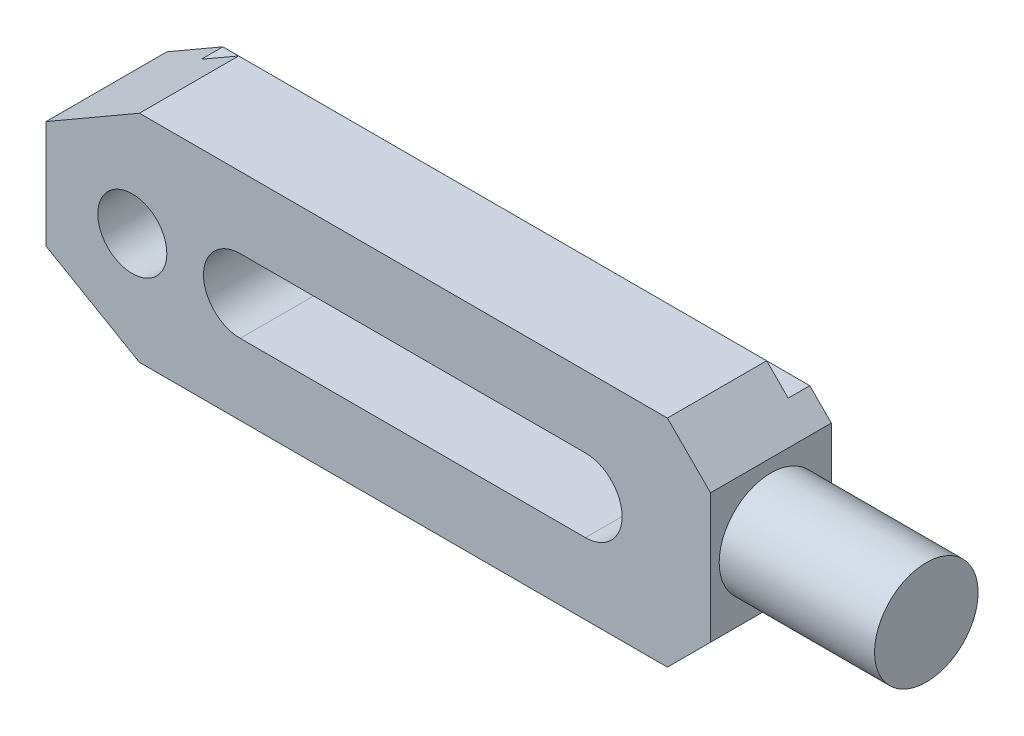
ISO-10303-21;
HEADER;
FILE_DESCRIPTION(('STEP AP214'),'2;1');
FILE_NAME('part.step','',(''),(''),'','','');
FILE_SCHEMA(('AUTOMOTIVE_DESIGN { 1 0 10303 214 1 1 1 1 }'));
ENDSEC;
DATA;
#1=APPLICATION_CONTEXT('core data for automotive mechanical design processes');
#2=APPLICATION_PROTOCOL_DEFINITION('international standard','automotive_design',2000,#1);
#3=PRODUCT_CONTEXT('',#1,'mechanical');
#4=PRODUCT('Part','Part','',(#3));
#5=PRODUCT_RELATED_PRODUCT_CATEGORY('part','',(#4));
#6=PRODUCT_DEFINITION_FORMATION('','',#4);
#7=PRODUCT_DEFINITION_CONTEXT('part definition',#1,'design');
#8=PRODUCT_DEFINITION('design','',#6,#7);
#9=PRODUCT_DEFINITION_SHAPE('','',#8);
#10=(LENGTH_UNIT() NAMED_UNIT(*) SI_UNIT(.MILLI.,.METRE.));
#11=(NAMED_UNIT(*) PLANE_ANGLE_UNIT() SI_UNIT($,.RADIAN.));
#12=(NAMED_UNIT(*) SI_UNIT($,.STERADIAN.) SOLID_ANGLE_UNIT());
#13=UNCERTAINTY_MEASURE_WITH_UNIT(LENGTH_MEASURE(1.E-05),#10,'distance_accuracy_value','');
#14=(GEOMETRIC_REPRESENTATION_CONTEXT(3) GLOBAL_UNCERTAINTY_ASSIGNED_CONTEXT((#13)) GLOBAL_UNIT_ASSIGNED_CONTEXT((#10,
#11,#12)) REPRESENTATION_CONTEXT('',''));
#15=CARTESIAN_POINT('',(0.,0.,0.));
#16=DIRECTION('',(0.,0.,1.));
#17=DIRECTION('',(1.,0.,0.));
#18=AXIS2_PLACEMENT_3D('',#15,#16,#17);
#19=CARTESIAN_POINT('',(-125.,-20.,0.));
#20=DIRECTION('',(0.,0.,-1.));
#21=DIRECTION('',(0.,-1.,0.));
#22=AXIS2_PLACEMENT_3D('',#19,#20,#21);
#23=PLANE('',#22);
#24=CARTESIAN_POINT('',(-105.,0.,0.));
#25=DIRECTION('',(0.,0.,1.));
#26=DIRECTION('',(0.,1.,0.));
#27=AXIS2_PLACEMENT_3D('',#24,#25,#26);
#28=CIRCLE('',#27,8.);
#29=CARTESIAN_POINT('',(-105.,8.,0.));
#30=VERTEX_POINT('',#29);
#31=EDGE_CURVE('E133',#30,#30,#28,.T.);
#32=ORIENTED_EDGE('',*,*,#31,.T.);
#33=EDGE_LOOP('',(#32));
#34=FACE_BOUND('',#33,.T.);
#35=DIRECTION('',(0.,1.,0.));
#36=VECTOR('',#35,1.);
#37=CARTESIAN_POINT('',(-125.,-20.,0.));
#38=LINE('',#37,#36);
#39=CARTESIAN_POINT('',(-125.,-12.5,0.));
#40=VERTEX_POINT('',#39);
#41=CARTESIAN_POINT('',(-125.,12.5,0.));
#42=VERTEX_POINT('',#41);
#43=EDGE_CURVE('E239',#40,#42,#38,.T.);
#44=ORIENTED_EDGE('',*,*,#43,.T.);
#45=DIRECTION('',(0.866025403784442,0.5,0.));
#46=VECTOR('',#45,1.);
#47=CARTESIAN_POINT('',(-125.,12.5,0.));
#48=LINE('',#47,#46);
#49=CARTESIAN_POINT('',(-112.009618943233,20.,0.));
#50=VERTEX_POINT('',#49);
#51=EDGE_CURVE('E167',#42,#50,#48,.T.);
#52=ORIENTED_EDGE('',*,*,#51,.T.);
#53=DIRECTION('',(1.,0.,0.));
#54=VECTOR('',#53,1.);
#55=CARTESIAN_POINT('',(-125.,20.,0.));
#56=LINE('',#55,#54);
#57=CARTESIAN_POINT('',(24.,20.,0.));
#58=VERTEX_POINT('',#57);
#59=EDGE_CURVE('E253',#50,#58,#56,.T.);
#60=ORIENTED_EDGE('',*,*,#59,.T.);
#61=DIRECTION('',(-0.707106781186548,0.707106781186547,0.));
#62=VECTOR('',#61,1.);
#63=CARTESIAN_POINT('',(29.,15.,0.));
#64=LINE('',#63,#62);
#65=CARTESIAN_POINT('',(29.,15.,0.));
#66=VERTEX_POINT('',#65);
#67=EDGE_CURVE('E197',#66,#58,#64,.T.);
#68=ORIENTED_EDGE('',*,*,#67,.F.);
#69=DIRECTION('',(0.,1.,0.));
#70=VECTOR('',#69,1.);
#71=CARTESIAN_POINT('',(29.,-20.,0.));
#72=LINE('',#71,#70);
#73=CARTESIAN_POINT('',(29.,-15.,0.));
#74=VERTEX_POINT('',#73);
#75=EDGE_CURVE('E235',#74,#66,#72,.T.);
#76=ORIENTED_EDGE('',*,*,#75,.F.);
#77=DIRECTION('',(-0.707106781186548,-0.707106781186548,0.));
#78=VECTOR('',#77,1.);
#79=CARTESIAN_POINT('',(29.,-15.,0.));
#80=LINE('',#79,#78);
#81=CARTESIAN_POINT('',(24.,-20.,0.));
#82=VERTEX_POINT('',#81);
#83=EDGE_CURVE('E211',#74,#82,#80,.T.);
#84=ORIENTED_EDGE('',*,*,#83,.T.);
#85=DIRECTION('',(1.,0.,0.));
#86=VECTOR('',#85,1.);
#87=CARTESIAN_POINT('',(-125.,-20.,0.));
#88=LINE('',#87,#86);
#89=CARTESIAN_POINT('',(-112.009618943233,-20.,0.));
#90=VERTEX_POINT('',#89);
#91=EDGE_CURVE('E251',#90,#82,#88,.T.);
#92=ORIENTED_EDGE('',*,*,#91,.F.);
#93=DIRECTION('',(0.866025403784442,-0.5,0.));
#94=VECTOR('',#93,1.);
#95=CARTESIAN_POINT('',(-125.,-12.5,0.));
#96=LINE('',#95,#94);
#97=EDGE_CURVE('E184',#40,#90,#96,.T.);
#98=ORIENTED_EDGE('',*,*,#97,.F.);
#99=EDGE_LOOP('',(#44,#52,#60,#68,#76,#84,#92,#98));
#100=FACE_BOUND('',#99,.T.);
#101=DIRECTION('',(-1.,0.,0.));
#102=VECTOR('',#101,1.);
#103=CARTESIAN_POINT('',(0.,-8.5,0.));
#104=LINE('',#103,#102);
#105=CARTESIAN_POINT('',(0.,-8.5,0.));
#106=VERTEX_POINT('',#105);
#107=CARTESIAN_POINT('',(-80.,-8.5,0.));
#108=VERTEX_POINT('',#107);
#109=EDGE_CURVE('E146',#106,#108,#104,.T.);
#110=ORIENTED_EDGE('',*,*,#109,.F.);
#111=CARTESIAN_POINT('',(0.,0.,0.));
#112=DIRECTION('',(0.,0.,1.));
#113=DIRECTION('',(0.,1.,0.));
#114=AXIS2_PLACEMENT_3D('',#111,#112,#113);
#115=CIRCLE('',#114,8.5);
#116=CARTESIAN_POINT('',(0.,8.5,0.));
#117=VERTEX_POINT('',#116);
#118=EDGE_CURVE('E29',#106,#117,#115,.T.);
#119=ORIENTED_EDGE('',*,*,#118,.T.);
#120=DIRECTION('',(1.,0.,0.));
#121=VECTOR('',#120,1.);
#122=CARTESIAN_POINT('',(-80.,8.5,0.));
#123=LINE('',#122,#121);
#124=CARTESIAN_POINT('',(-80.,8.5,0.));
#125=VERTEX_POINT('',#124);
#126=EDGE_CURVE('E137',#125,#117,#123,.T.);
#127=ORIENTED_EDGE('',*,*,#126,.F.);
#128=CARTESIAN_POINT('',(-80.,0.,0.));
#129=DIRECTION('',(0.,0.,1.));
#130=DIRECTION('',(0.,1.,0.));
#131=AXIS2_PLACEMENT_3D('',#128,#129,#130);
#132=CIRCLE('',#131,8.5);
#133=EDGE_CURVE('E142',#125,#108,#132,.T.);
#134=ORIENTED_EDGE('',*,*,#133,.T.);
#135=EDGE_LOOP('',(#110,#119,#127,#134));
#136=FACE_BOUND('',#135,.T.);
#137=ADVANCED_FACE('F14',(#34,#100,#136),#23,.T.);
#138=CARTESIAN_POINT('',(-125.,25.,28.));
#139=DIRECTION('',(0.,0.,1.));
#140=DIRECTION('',(0.,1.,0.));
#141=AXIS2_PLACEMENT_3D('',#138,#139,#140);
#142=PLANE('',#141);
#143=CARTESIAN_POINT('',(-105.,0.,28.));
#144=DIRECTION('',(0.,0.,1.));
#145=DIRECTION('',(0.,1.,0.));
#146=AXIS2_PLACEMENT_3D('',#143,#144,#145);
#147=CIRCLE('',#146,8.);
#148=CARTESIAN_POINT('',(-105.,8.,28.));
#149=VERTEX_POINT('',#148);
#150=EDGE_CURVE('E164',#149,#149,#147,.T.);
#151=ORIENTED_EDGE('',*,*,#150,.F.);
#152=EDGE_LOOP('',(#151));
#153=FACE_BOUND('',#152,.T.);
#154=DIRECTION('',(1.,0.,0.));
#155=VECTOR('',#154,1.);
#156=CARTESIAN_POINT('',(-125.,25.,28.));
#157=LINE('',#156,#155);
#158=CARTESIAN_POINT('',(-103.349364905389,25.,28.));
#159=VERTEX_POINT('',#158);
#160=CARTESIAN_POINT('',(19.,25.,28.));
#161=VERTEX_POINT('',#160);
#162=EDGE_CURVE('E242',#159,#161,#157,.T.);
#163=ORIENTED_EDGE('',*,*,#162,.F.);
#164=DIRECTION('',(0.866025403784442,0.5,0.));
#165=VECTOR('',#164,1.);
#166=CARTESIAN_POINT('',(-125.,12.5,28.));
#167=LINE('',#166,#165);
#168=CARTESIAN_POINT('',(-125.,12.5,28.));
#169=VERTEX_POINT('',#168);
#170=EDGE_CURVE('E170',#169,#159,#167,.T.);
#171=ORIENTED_EDGE('',*,*,#170,.F.);
#172=DIRECTION('',(0.,-1.,0.));
#173=VECTOR('',#172,1.);
#174=CARTESIAN_POINT('',(-125.,25.,28.));
#175=LINE('',#174,#173);
#176=CARTESIAN_POINT('',(-125.,-12.5,28.));
#177=VERTEX_POINT('',#176);
#178=EDGE_CURVE('E238',#169,#177,#175,.T.);
#179=ORIENTED_EDGE('',*,*,#178,.T.);
#180=DIRECTION('',(0.866025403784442,-0.5,0.));
#181=VECTOR('',#180,1.);
#182=CARTESIAN_POINT('',(-125.,-12.5,28.));
#183=LINE('',#182,#181);
#184=CARTESIAN_POINT('',(-103.349364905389,-25.,28.));
#185=VERTEX_POINT('',#184);
#186=EDGE_CURVE('E186',#177,#185,#183,.T.);
#187=ORIENTED_EDGE('',*,*,#186,.T.);
#188=DIRECTION('',(1.,0.,0.));
#189=VECTOR('',#188,1.);
#190=CARTESIAN_POINT('',(-125.,-25.,28.));
#191=LINE('',#190,#189);
#192=CARTESIAN_POINT('',(19.,-25.,28.));
#193=VERTEX_POINT('',#192);
#194=EDGE_CURVE('E245',#185,#193,#191,.T.);
#195=ORIENTED_EDGE('',*,*,#194,.T.);
#196=DIRECTION('',(-0.707106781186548,-0.707106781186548,0.));
#197=VECTOR('',#196,1.);
#198=CARTESIAN_POINT('',(29.,-15.,28.));
#199=LINE('',#198,#197);
#200=CARTESIAN_POINT('',(29.,-15.,28.));
#201=VERTEX_POINT('',#200);
#202=EDGE_CURVE('E214',#201,#193,#199,.T.);
#203=ORIENTED_EDGE('',*,*,#202,.F.);
#204=DIRECTION('',(0.,-1.,0.));
#205=VECTOR('',#204,1.);
#206=CARTESIAN_POINT('',(29.,25.,28.));
#207=LINE('',#206,#205);
#208=CARTESIAN_POINT('',(29.,15.,28.));
#209=VERTEX_POINT('',#208);
#210=EDGE_CURVE('E22',#209,#201,#207,.T.);
#211=ORIENTED_EDGE('',*,*,#210,.F.);
#212=DIRECTION('',(-0.707106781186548,0.707106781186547,0.));
#213=VECTOR('',#212,1.);
#214=CARTESIAN_POINT('',(29.,15.,28.));
#215=LINE('',#214,#213);
#216=EDGE_CURVE('E200',#209,#161,#215,.T.);
#217=ORIENTED_EDGE('',*,*,#216,.T.);
#218=EDGE_LOOP('',(#163,#171,#179,#187,#195,#203,#211,#217));
#219=FACE_BOUND('',#218,.T.);
#220=DIRECTION('',(1.,0.,0.));
#221=VECTOR('',#220,1.);
#222=CARTESIAN_POINT('',(-80.,8.5,28.));
#223=LINE('',#222,#221);
#224=CARTESIAN_POINT('',(-80.,8.5,28.));
#225=VERTEX_POINT('',#224);
#226=CARTESIAN_POINT('',(0.,8.5,28.));
#227=VERTEX_POINT('',#226);
#228=EDGE_CURVE('E155',#225,#227,#223,.T.);
#229=ORIENTED_EDGE('',*,*,#228,.T.);
#230=CARTESIAN_POINT('',(0.,0.,28.));
#231=DIRECTION('',(0.,0.,1.));
#232=DIRECTION('',(0.,1.,0.));
#233=AXIS2_PLACEMENT_3D('',#230,#231,#232);
#234=CIRCLE('',#233,8.5);
#235=CARTESIAN_POINT('',(0.,-8.5,28.));
#236=VERTEX_POINT('',#235);
#237=EDGE_CURVE('E129',#236,#227,#234,.T.);
#238=ORIENTED_EDGE('',*,*,#237,.F.);
#239=DIRECTION('',(-1.,0.,0.));
#240=VECTOR('',#239,1.);
#241=CARTESIAN_POINT('',(0.,-8.5,28.));
#242=LINE('',#241,#240);
#243=CARTESIAN_POINT('',(-80.,-8.5,28.));
#244=VERTEX_POINT('',#243);
#245=EDGE_CURVE('E150',#236,#244,#242,.T.);
#246=ORIENTED_EDGE('',*,*,#245,.T.);
#247=CARTESIAN_POINT('',(-80.,0.,28.));
#248=DIRECTION('',(0.,0.,1.));
#249=DIRECTION('',(0.,1.,0.));
#250=AXIS2_PLACEMENT_3D('',#247,#248,#249);
#251=CIRCLE('',#250,8.5);
#252=EDGE_CURVE('E37',#225,#244,#251,.T.);
#253=ORIENTED_EDGE('',*,*,#252,.F.);
#254=EDGE_LOOP('',(#229,#238,#246,#253));
#255=FACE_BOUND('',#254,.T.);
#256=ADVANCED_FACE('F271',(#153,#219,#255),#142,.T.);
#257=CARTESIAN_POINT('',(-125.,25.,5.));
#258=DIRECTION('',(0.,1.,0.));
#259=DIRECTION('',(0.,0.,-1.));
#260=AXIS2_PLACEMENT_3D('',#257,#258,#259);
#261=PLANE('',#260);
#262=DIRECTION('',(1.,0.,0.));
#263=VECTOR('',#262,1.);
#264=CARTESIAN_POINT('',(-125.,25.,5.));
#265=LINE('',#264,#263);
#266=CARTESIAN_POINT('',(-103.349364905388,25.,5.));
#267=VERTEX_POINT('',#266);
#268=CARTESIAN_POINT('',(19.,25.,5.));
#269=VERTEX_POINT('',#268);
#270=EDGE_CURVE('E257',#267,#269,#265,.T.);
#271=ORIENTED_EDGE('',*,*,#270,.F.);
#272=DIRECTION('',(0.,0.,1.));
#273=VECTOR('',#272,1.);
#274=CARTESIAN_POINT('',(-103.349364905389,25.,5.));
#275=LINE('',#274,#273);
#276=EDGE_CURVE('E181',#267,#159,#275,.T.);
#277=ORIENTED_EDGE('',*,*,#276,.T.);
#278=ORIENTED_EDGE('',*,*,#162,.T.);
#279=DIRECTION('',(0.,0.,-1.));
#280=VECTOR('',#279,1.);
#281=CARTESIAN_POINT('',(19.,25.,28.));
#282=LINE('',#281,#280);
#283=EDGE_CURVE('E205',#161,#269,#282,.T.);
#284=ORIENTED_EDGE('',*,*,#283,.T.);
#285=EDGE_LOOP('',(#271,#277,#278,#284));
#286=FACE_BOUND('',#285,.T.);
#287=ADVANCED_FACE('F303',(#286),#261,.T.);
#288=CARTESIAN_POINT('',(-125.,20.,5.));
#289=DIRECTION('',(0.,0.,-1.));
#290=DIRECTION('',(0.,-1.,0.));
#291=AXIS2_PLACEMENT_3D('',#288,#289,#290);
#292=PLANE('',#291);
#293=DIRECTION('',(1.,0.,0.));
#294=VECTOR('',#293,1.);
#295=CARTESIAN_POINT('',(-125.,20.,5.));
#296=LINE('',#295,#294);
#297=CARTESIAN_POINT('',(-112.009618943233,20.,5.));
#298=VERTEX_POINT('',#297);
#299=CARTESIAN_POINT('',(24.,20.,5.));
#300=VERTEX_POINT('',#299);
#301=EDGE_CURVE('E255',#298,#300,#296,.T.);
#302=ORIENTED_EDGE('',*,*,#301,.F.);
#303=DIRECTION('',(0.866025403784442,0.5,0.));
#304=VECTOR('',#303,1.);
#305=CARTESIAN_POINT('',(-121.752404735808,14.375,5.));
#306=LINE('',#305,#304);
#307=EDGE_CURVE('E178',#298,#267,#306,.T.);
#308=ORIENTED_EDGE('',*,*,#307,.T.);
#309=ORIENTED_EDGE('',*,*,#270,.T.);
#310=DIRECTION('',(-0.707106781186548,0.707106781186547,0.));
#311=VECTOR('',#310,1.);
#312=CARTESIAN_POINT('',(-50.5,94.5,5.));
#313=LINE('',#312,#311);
#314=EDGE_CURVE('E208',#300,#269,#313,.T.);
#315=ORIENTED_EDGE('',*,*,#314,.F.);
#316=EDGE_LOOP('',(#302,#308,#309,#315));
#317=FACE_BOUND('',#316,.T.);
#318=ADVANCED_FACE('F16',(#317),#292,.T.);
#319=CARTESIAN_POINT('',(-125.,20.,0.));
#320=DIRECTION('',(0.,1.,0.));
#321=DIRECTION('',(0.,0.,-1.));
#322=AXIS2_PLACEMENT_3D('',#319,#320,#321);
#323=PLANE('',#322);
#324=ORIENTED_EDGE('',*,*,#59,.F.);
#325=DIRECTION('',(0.,0.,1.));
#326=VECTOR('',#325,1.);
#327=CARTESIAN_POINT('',(-112.009618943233,20.,0.));
#328=LINE('',#327,#326);
#329=EDGE_CURVE('E175',#50,#298,#328,.T.);
#330=ORIENTED_EDGE('',*,*,#329,.T.);
#331=ORIENTED_EDGE('',*,*,#301,.T.);
#332=DIRECTION('',(0.,0.,1.));
#333=VECTOR('',#332,1.);
#334=CARTESIAN_POINT('',(24.,20.,-1.05838731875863E-13));
#335=LINE('',#334,#333);
#336=EDGE_CURVE('E9',#58,#300,#335,.T.);
#337=ORIENTED_EDGE('',*,*,#336,.F.);
#338=EDGE_LOOP('',(#324,#330,#331,#337));
#339=FACE_BOUND('',#338,.T.);
#340=ADVANCED_FACE('F297',(#339),#323,.T.);
#341=CARTESIAN_POINT('',(-125.,25.,28.));
#342=DIRECTION('',(1.,0.,0.));
#343=DIRECTION('',(0.,0.,-1.));
#344=AXIS2_PLACEMENT_3D('',#341,#342,#343);
#345=PLANE('',#344);
#346=DIRECTION('',(0.,0.,-1.));
#347=VECTOR('',#346,1.);
#348=CARTESIAN_POINT('',(-125.,12.5,28.));
#349=LINE('',#348,#347);
#350=EDGE_CURVE('E172',#169,#42,#349,.T.);
#351=ORIENTED_EDGE('',*,*,#350,.T.);
#352=ORIENTED_EDGE('',*,*,#43,.F.);
#353=DIRECTION('',(0.,0.,-1.));
#354=VECTOR('',#353,1.);
#355=CARTESIAN_POINT('',(-125.,-12.5,28.));
#356=LINE('',#355,#354);
#357=EDGE_CURVE('E189',#177,#40,#356,.T.);
#358=ORIENTED_EDGE('',*,*,#357,.F.);
#359=ORIENTED_EDGE('',*,*,#178,.F.);
#360=EDGE_LOOP('',(#351,#352,#358,#359));
#361=FACE_BOUND('',#360,.T.);
#362=ADVANCED_FACE('F309',(#361),#345,.F.);
#363=CARTESIAN_POINT('',(-125.,-20.,5.));
#364=DIRECTION('',(0.,-1.,0.));
#365=DIRECTION('',(0.,0.,1.));
#366=AXIS2_PLACEMENT_3D('',#363,#364,#365);
#367=PLANE('',#366);
#368=DIRECTION('',(0.,0.,1.));
#369=VECTOR('',#368,1.);
#370=CARTESIAN_POINT('',(-112.009618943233,-20.,5.));
#371=LINE('',#370,#369);
#372=CARTESIAN_POINT('',(-112.009618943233,-20.,5.));
#373=VERTEX_POINT('',#372);
#374=EDGE_CURVE('E195',#90,#373,#371,.T.);
#375=ORIENTED_EDGE('',*,*,#374,.F.);
#376=ORIENTED_EDGE('',*,*,#91,.T.);
#377=DIRECTION('',(0.,0.,1.));
#378=VECTOR('',#377,1.);
#379=CARTESIAN_POINT('',(24.,-20.,5.0000000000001));
#380=LINE('',#379,#378);
#381=CARTESIAN_POINT('',(24.,-20.,5.));
#382=VERTEX_POINT('',#381);
#383=EDGE_CURVE('E226',#82,#382,#380,.T.);
#384=ORIENTED_EDGE('',*,*,#383,.T.);
#385=DIRECTION('',(1.,0.,0.));
#386=VECTOR('',#385,1.);
#387=CARTESIAN_POINT('',(-125.,-20.,5.));
#388=LINE('',#387,#386);
#389=EDGE_CURVE('E249',#373,#382,#388,.T.);
#390=ORIENTED_EDGE('',*,*,#389,.F.);
#391=EDGE_LOOP('',(#375,#376,#384,#390));
#392=FACE_BOUND('',#391,.T.);
#393=ADVANCED_FACE('F286',(#392),#367,.T.);
#394=CARTESIAN_POINT('',(-125.,-25.,5.));
#395=DIRECTION('',(0.,0.,-1.));
#396=DIRECTION('',(0.,-1.,0.));
#397=AXIS2_PLACEMENT_3D('',#394,#395,#396);
#398=PLANE('',#397);
#399=DIRECTION('',(0.866025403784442,-0.5,0.));
#400=VECTOR('',#399,1.);
#401=CARTESIAN_POINT('',(-119.587341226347,-15.625,5.));
#402=LINE('',#401,#400);
#403=CARTESIAN_POINT('',(-103.349364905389,-25.,5.));
#404=VERTEX_POINT('',#403);
#405=EDGE_CURVE('E193',#373,#404,#402,.T.);
#406=ORIENTED_EDGE('',*,*,#405,.F.);
#407=ORIENTED_EDGE('',*,*,#389,.T.);
#408=DIRECTION('',(-0.707106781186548,-0.707106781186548,0.));
#409=VECTOR('',#408,1.);
#410=CARTESIAN_POINT('',(-53.,-97.,5.));
#411=LINE('',#410,#409);
#412=CARTESIAN_POINT('',(19.,-25.,5.));
#413=VERTEX_POINT('',#412);
#414=EDGE_CURVE('E223',#382,#413,#411,.T.);
#415=ORIENTED_EDGE('',*,*,#414,.T.);
#416=DIRECTION('',(1.,0.,0.));
#417=VECTOR('',#416,1.);
#418=CARTESIAN_POINT('',(-125.,-25.,5.));
#419=LINE('',#418,#417);
#420=EDGE_CURVE('E247',#404,#413,#419,.T.);
#421=ORIENTED_EDGE('',*,*,#420,.F.);
#422=EDGE_LOOP('',(#406,#407,#415,#421));
#423=FACE_BOUND('',#422,.T.);
#424=ADVANCED_FACE('F282',(#423),#398,.T.);
#425=CARTESIAN_POINT('',(-125.,-25.,28.));
#426=DIRECTION('',(0.,-1.,0.));
#427=DIRECTION('',(0.,0.,1.));
#428=AXIS2_PLACEMENT_3D('',#425,#426,#427);
#429=PLANE('',#428);
#430=DIRECTION('',(0.,0.,1.));
#431=VECTOR('',#430,1.);
#432=CARTESIAN_POINT('',(-103.349364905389,-25.,28.));
#433=LINE('',#432,#431);
#434=EDGE_CURVE('E191',#404,#185,#433,.T.);
#435=ORIENTED_EDGE('',*,*,#434,.F.);
#436=ORIENTED_EDGE('',*,*,#420,.T.);
#437=DIRECTION('',(0.,0.,-1.));
#438=VECTOR('',#437,1.);
#439=CARTESIAN_POINT('',(19.,-25.,28.));
#440=LINE('',#439,#438);
#441=EDGE_CURVE('E217',#193,#413,#440,.T.);
#442=ORIENTED_EDGE('',*,*,#441,.F.);
#443=ORIENTED_EDGE('',*,*,#194,.F.);
#444=EDGE_LOOP('',(#435,#436,#442,#443));
#445=FACE_BOUND('',#444,.T.);
#446=ADVANCED_FACE('F277',(#445),#429,.T.);
#447=CARTESIAN_POINT('',(29.,-30.,30.));
#448=DIRECTION('',(-1.,0.,0.));
#449=DIRECTION('',(0.,0.,1.));
#450=AXIS2_PLACEMENT_3D('',#447,#448,#449);
#451=PLANE('',#450);
#452=CARTESIAN_POINT('',(29.,0.,14.));
#453=DIRECTION('',(-1.,0.,0.));
#454=DIRECTION('',(0.,0.,1.));
#455=AXIS2_PLACEMENT_3D('',#452,#453,#454);
#456=CIRCLE('',#455,12.);
#457=CARTESIAN_POINT('',(29.,0.,26.));
#458=VERTEX_POINT('',#457);
#459=EDGE_CURVE('E232',#458,#458,#456,.T.);
#460=ORIENTED_EDGE('',*,*,#459,.T.);
#461=EDGE_LOOP('',(#460));
#462=FACE_BOUND('',#461,.T.);
#463=ORIENTED_EDGE('',*,*,#75,.T.);
#464=DIRECTION('',(0.,0.,-1.));
#465=VECTOR('',#464,1.);
#466=CARTESIAN_POINT('',(29.,15.,28.));
#467=LINE('',#466,#465);
#468=EDGE_CURVE('E203',#209,#66,#467,.T.);
#469=ORIENTED_EDGE('',*,*,#468,.F.);
#470=ORIENTED_EDGE('',*,*,#210,.T.);
#471=DIRECTION('',(0.,0.,-1.));
#472=VECTOR('',#471,1.);
#473=CARTESIAN_POINT('',(29.,-15.,28.));
#474=LINE('',#473,#472);
#475=EDGE_CURVE('E220',#201,#74,#474,.T.);
#476=ORIENTED_EDGE('',*,*,#475,.T.);
#477=EDGE_LOOP('',(#463,#469,#470,#476));
#478=FACE_BOUND('',#477,.T.);
#479=ADVANCED_FACE('F262',(#462,#478),#451,.F.);
#480=CARTESIAN_POINT('',(29.,0.,14.));
#481=DIRECTION('',(1.,0.,0.));
#482=DIRECTION('',(0.,0.,-1.));
#483=AXIS2_PLACEMENT_3D('',#480,#481,#482);
#484=CYLINDRICAL_SURFACE('',#483,12.);
#485=ORIENTED_EDGE('',*,*,#459,.F.);
#486=EDGE_LOOP('',(#485));
#487=FACE_BOUND('',#486,.T.);
#488=CARTESIAN_POINT('',(65.,0.,14.));
#489=DIRECTION('',(-1.,0.,0.));
#490=DIRECTION('',(0.,0.,1.));
#491=AXIS2_PLACEMENT_3D('',#488,#489,#490);
#492=CIRCLE('',#491,12.);
#493=CARTESIAN_POINT('',(65.,0.,26.));
#494=VERTEX_POINT('',#493);
#495=EDGE_CURVE('E229',#494,#494,#492,.T.);
#496=ORIENTED_EDGE('',*,*,#495,.T.);
#497=EDGE_LOOP('',(#496));
#498=FACE_BOUND('',#497,.T.);
#499=ADVANCED_FACE('F465',(#487,#498),#484,.T.);
#500=CARTESIAN_POINT('',(65.,25.,28.));
#501=DIRECTION('',(1.,0.,0.));
#502=DIRECTION('',(0.,0.,-1.));
#503=AXIS2_PLACEMENT_3D('',#500,#501,#502);
#504=PLANE('',#503);
#505=ORIENTED_EDGE('',*,*,#495,.F.);
#506=EDGE_LOOP('',(#505));
#507=FACE_BOUND('',#506,.T.);
#508=ADVANCED_FACE('F457',(#507),#504,.T.);
#509=CARTESIAN_POINT('',(29.,-15.,28.));
#510=DIRECTION('',(0.707106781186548,-0.707106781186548,0.));
#511=DIRECTION('',(0.707106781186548,0.707106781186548,0.));
#512=AXIS2_PLACEMENT_3D('',#509,#510,#511);
#513=PLANE('',#512);
#514=ORIENTED_EDGE('',*,*,#83,.F.);
#515=ORIENTED_EDGE('',*,*,#475,.F.);
#516=ORIENTED_EDGE('',*,*,#202,.T.);
#517=ORIENTED_EDGE('',*,*,#441,.T.);
#518=ORIENTED_EDGE('',*,*,#414,.F.);
#519=ORIENTED_EDGE('',*,*,#383,.F.);
#520=EDGE_LOOP('',(#514,#515,#516,#517,#518,#519));
#521=FACE_BOUND('',#520,.T.);
#522=ADVANCED_FACE('F267',(#521),#513,.T.);
#523=CARTESIAN_POINT('',(29.,15.,28.));
#524=DIRECTION('',(-0.707106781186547,-0.707106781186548,0.));
#525=DIRECTION('',(0.707106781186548,-0.707106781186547,0.));
#526=AXIS2_PLACEMENT_3D('',#523,#524,#525);
#527=PLANE('',#526);
#528=ORIENTED_EDGE('',*,*,#314,.T.);
#529=ORIENTED_EDGE('',*,*,#283,.F.);
#530=ORIENTED_EDGE('',*,*,#216,.F.);
#531=ORIENTED_EDGE('',*,*,#468,.T.);
#532=ORIENTED_EDGE('',*,*,#67,.T.);
#533=ORIENTED_EDGE('',*,*,#336,.T.);
#534=EDGE_LOOP('',(#528,#529,#530,#531,#532,#533));
#535=FACE_BOUND('',#534,.T.);
#536=ADVANCED_FACE('F294',(#535),#527,.F.);
#537=CARTESIAN_POINT('',(-125.,-12.5,28.));
#538=DIRECTION('',(0.5,0.866025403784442,0.));
#539=DIRECTION('',(-0.866025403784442,0.5,0.));
#540=AXIS2_PLACEMENT_3D('',#537,#538,#539);
#541=PLANE('',#540);
#542=ORIENTED_EDGE('',*,*,#374,.T.);
#543=ORIENTED_EDGE('',*,*,#405,.T.);
#544=ORIENTED_EDGE('',*,*,#434,.T.);
#545=ORIENTED_EDGE('',*,*,#186,.F.);
#546=ORIENTED_EDGE('',*,*,#357,.T.);
#547=ORIENTED_EDGE('',*,*,#97,.T.);
#548=EDGE_LOOP('',(#542,#543,#544,#545,#546,#547));
#549=FACE_BOUND('',#548,.T.);
#550=ADVANCED_FACE('F312',(#549),#541,.F.);
#551=CARTESIAN_POINT('',(-125.,12.5,28.));
#552=DIRECTION('',(-0.5,0.866025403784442,0.));
#553=DIRECTION('',(-0.866025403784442,-0.5,0.));
#554=AXIS2_PLACEMENT_3D('',#551,#552,#553);
#555=PLANE('',#554);
#556=ORIENTED_EDGE('',*,*,#307,.F.);
#557=ORIENTED_EDGE('',*,*,#329,.F.);
#558=ORIENTED_EDGE('',*,*,#51,.F.);
#559=ORIENTED_EDGE('',*,*,#350,.F.);
#560=ORIENTED_EDGE('',*,*,#170,.T.);
#561=ORIENTED_EDGE('',*,*,#276,.F.);
#562=EDGE_LOOP('',(#556,#557,#558,#559,#560,#561));
#563=FACE_BOUND('',#562,.T.);
#564=ADVANCED_FACE('F313',(#563),#555,.T.);
#565=CARTESIAN_POINT('',(-105.,0.,28.));
#566=DIRECTION('',(0.,0.,-1.));
#567=DIRECTION('',(0.,-1.,0.));
#568=AXIS2_PLACEMENT_3D('',#565,#566,#567);
#569=CYLINDRICAL_SURFACE('',#568,8.);
#570=ORIENTED_EDGE('',*,*,#150,.T.);
#571=EDGE_LOOP('',(#570));
#572=FACE_BOUND('',#571,.T.);
#573=ORIENTED_EDGE('',*,*,#31,.F.);
#574=EDGE_LOOP('',(#573));
#575=FACE_BOUND('',#574,.T.);
#576=ADVANCED_FACE('F315',(#572,#575),#569,.F.);
#577=CARTESIAN_POINT('',(0.,0.,28.));
#578=DIRECTION('',(0.,0.,-1.));
#579=DIRECTION('',(0.,-1.,0.));
#580=AXIS2_PLACEMENT_3D('',#577,#578,#579);
#581=CYLINDRICAL_SURFACE('',#580,8.5);
#582=DIRECTION('',(0.,0.,-1.));
#583=VECTOR('',#582,1.);
#584=CARTESIAN_POINT('',(0.,8.5,28.));
#585=LINE('',#584,#583);
#586=EDGE_CURVE('E125',#227,#117,#585,.T.);
#587=ORIENTED_EDGE('',*,*,#586,.T.);
#588=ORIENTED_EDGE('',*,*,#118,.F.);
#589=DIRECTION('',(0.,0.,-1.));
#590=VECTOR('',#589,1.);
#591=CARTESIAN_POINT('',(0.,-8.5,28.));
#592=LINE('',#591,#590);
#593=EDGE_CURVE('E153',#236,#106,#592,.T.);
#594=ORIENTED_EDGE('',*,*,#593,.F.);
#595=ORIENTED_EDGE('',*,*,#237,.T.);
#596=EDGE_LOOP('',(#587,#588,#594,#595));
#597=FACE_BOUND('',#596,.T.);
#598=ADVANCED_FACE('F127',(#597),#581,.F.);
#599=CARTESIAN_POINT('',(-80.,8.5,28.));
#600=DIRECTION('',(0.,1.,0.));
#601=DIRECTION('',(-1.,0.,0.));
#602=AXIS2_PLACEMENT_3D('',#599,#600,#601);
#603=PLANE('',#602);
#604=DIRECTION('',(0.,0.,-1.));
#605=VECTOR('',#604,1.);
#606=CARTESIAN_POINT('',(-80.,8.5,28.));
#607=LINE('',#606,#605);
#608=EDGE_CURVE('E134',#225,#125,#607,.T.);
#609=ORIENTED_EDGE('',*,*,#608,.T.);
#610=ORIENTED_EDGE('',*,*,#126,.T.);
#611=ORIENTED_EDGE('',*,*,#586,.F.);
#612=ORIENTED_EDGE('',*,*,#228,.F.);
#613=EDGE_LOOP('',(#609,#610,#611,#612));
#614=FACE_BOUND('',#613,.T.);
#615=ADVANCED_FACE('F138',(#614),#603,.F.);
#616=CARTESIAN_POINT('',(-80.,0.,28.));
#617=DIRECTION('',(0.,0.,-1.));
#618=DIRECTION('',(0.,-1.,0.));
#619=AXIS2_PLACEMENT_3D('',#616,#617,#618);
#620=CYLINDRICAL_SURFACE('',#619,8.5);
#621=DIRECTION('',(0.,0.,-1.));
#622=VECTOR('',#621,1.);
#623=CARTESIAN_POINT('',(-80.,-8.5,28.));
#624=LINE('',#623,#622);
#625=EDGE_CURVE('E159',#244,#108,#624,.T.);
#626=ORIENTED_EDGE('',*,*,#625,.T.);
#627=ORIENTED_EDGE('',*,*,#133,.F.);
#628=ORIENTED_EDGE('',*,*,#608,.F.);
#629=ORIENTED_EDGE('',*,*,#252,.T.);
#630=EDGE_LOOP('',(#626,#627,#628,#629));
#631=FACE_BOUND('',#630,.T.);
#632=ADVANCED_FACE('F425',(#631),#620,.F.);
#633=CARTESIAN_POINT('',(0.,-8.5,28.));
#634=DIRECTION('',(0.,-1.,0.));
#635=DIRECTION('',(0.,0.,1.));
#636=AXIS2_PLACEMENT_3D('',#633,#634,#635);
#637=PLANE('',#636);
#638=ORIENTED_EDGE('',*,*,#245,.F.);
#639=ORIENTED_EDGE('',*,*,#593,.T.);
#640=ORIENTED_EDGE('',*,*,#109,.T.);
#641=ORIENTED_EDGE('',*,*,#625,.F.);
#642=EDGE_LOOP('',(#638,#639,#640,#641));
#643=FACE_BOUND('',#642,.T.);
#644=ADVANCED_FACE('F434',(#643),#637,.F.);
#645=CLOSED_SHELL('',(#137,#256,#287,#318,#340,#362,#393,#424,#446,#479,#499,#508,#522,#536,
#550,#564,#576,#598,#615,#632,#644));
#646=MANIFOLD_SOLID_BREP('B1',#645);
#647=ADVANCED_BREP_SHAPE_REPRESENTATION('',(#18,#646),#14);
#648=SHAPE_DEFINITION_REPRESENTATION(#9,#647);
ENDSEC;
END-ISO-10303-21;
